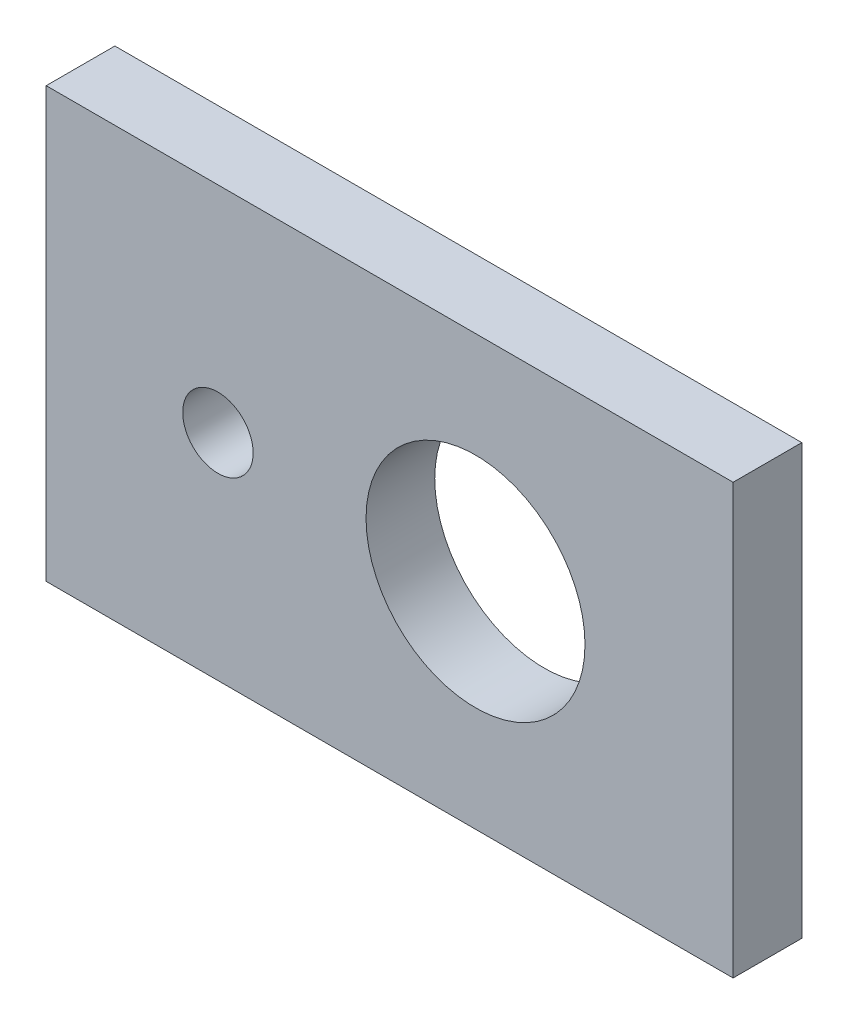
from build123d import *

# Parameters (mm, degrees)
ESQUISSE1_W          = 80
ESQUISSE1_H          = 50
ESQUISSE1_R          = 12.75
ESQUISSE1_R_2        = 4.1
BASE_EXTRUSION_DEPTH = 8


with BuildPart() as part:
    # Esquisse1 → Base-Extrusion (new body)
    with BuildSketch(Plane.XY):
        with Locations((-40, 25)):
            Rectangle(ESQUISSE1_W, ESQUISSE1_H)
        with Locations((-30, 25)):
            Circle(ESQUISSE1_R, mode=Mode.SUBTRACT)
        with Locations((-60, 25)):
            Circle(ESQUISSE1_R_2, mode=Mode.SUBTRACT)
    extrude(amount=BASE_EXTRUSION_DEPTH)


solid = part.part
